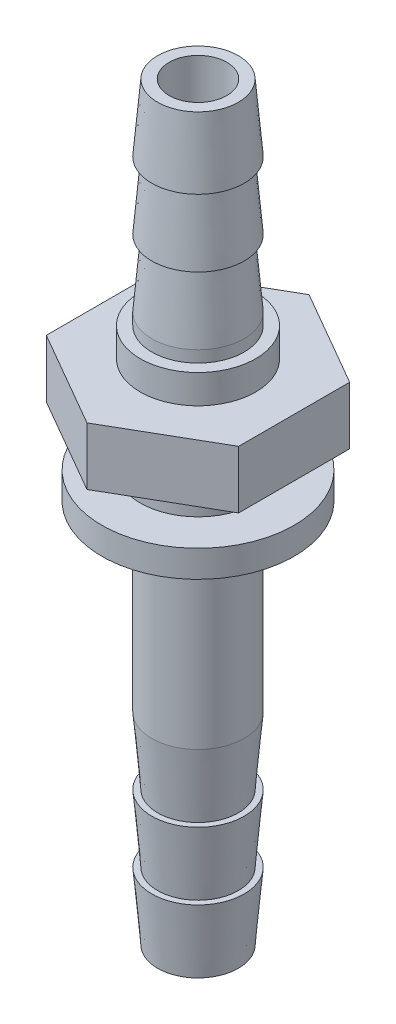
ISO-10303-21;
HEADER;
FILE_DESCRIPTION(('STEP AP214'),'2;1');
FILE_NAME('part.step','',(''),(''),'','','');
FILE_SCHEMA(('AUTOMOTIVE_DESIGN { 1 0 10303 214 1 1 1 1 }'));
ENDSEC;
DATA;
#1=APPLICATION_CONTEXT('core data for automotive mechanical design processes');
#2=APPLICATION_PROTOCOL_DEFINITION('international standard','automotive_design',2000,#1);
#3=PRODUCT_CONTEXT('',#1,'mechanical');
#4=PRODUCT('Part','Part','',(#3));
#5=PRODUCT_RELATED_PRODUCT_CATEGORY('part','',(#4));
#6=PRODUCT_DEFINITION_FORMATION('','',#4);
#7=PRODUCT_DEFINITION_CONTEXT('part definition',#1,'design');
#8=PRODUCT_DEFINITION('design','',#6,#7);
#9=PRODUCT_DEFINITION_SHAPE('','',#8);
#10=(LENGTH_UNIT() NAMED_UNIT(*) SI_UNIT(.MILLI.,.METRE.));
#11=(NAMED_UNIT(*) PLANE_ANGLE_UNIT() SI_UNIT($,.RADIAN.));
#12=(NAMED_UNIT(*) SI_UNIT($,.STERADIAN.) SOLID_ANGLE_UNIT());
#13=UNCERTAINTY_MEASURE_WITH_UNIT(LENGTH_MEASURE(1.E-05),#10,'distance_accuracy_value','');
#14=(GEOMETRIC_REPRESENTATION_CONTEXT(3) GLOBAL_UNCERTAINTY_ASSIGNED_CONTEXT((#13)) GLOBAL_UNIT_ASSIGNED_CONTEXT((#10,
#11,#12)) REPRESENTATION_CONTEXT('',''));
#15=CARTESIAN_POINT('',(0.,0.,0.));
#16=DIRECTION('',(0.,0.,1.));
#17=DIRECTION('',(1.,0.,0.));
#18=AXIS2_PLACEMENT_3D('',#15,#16,#17);
#19=CARTESIAN_POINT('',(0.,0.,0.));
#20=DIRECTION('',(0.,-1.,0.));
#21=DIRECTION('',(0.,0.,-1.));
#22=AXIS2_PLACEMENT_3D('',#19,#20,#21);
#23=CYLINDRICAL_SURFACE('',#22,3.);
#24=CARTESIAN_POINT('',(0.,1.4,0.));
#25=DIRECTION('',(0.,-1.,0.));
#26=DIRECTION('',(0.,0.,-1.));
#27=AXIS2_PLACEMENT_3D('',#24,#25,#26);
#28=CIRCLE('',#27,3.);
#29=CARTESIAN_POINT('',(0.,1.4,-3.));
#30=VERTEX_POINT('',#29);
#31=EDGE_CURVE('E199',#30,#30,#28,.T.);
#32=ORIENTED_EDGE('',*,*,#31,.F.);
#33=EDGE_LOOP('',(#32));
#34=FACE_BOUND('',#33,.T.);
#35=CARTESIAN_POINT('',(0.,3.4,0.));
#36=DIRECTION('',(0.,1.,0.));
#37=DIRECTION('',(0.,0.,1.));
#38=AXIS2_PLACEMENT_3D('',#35,#36,#37);
#39=CIRCLE('',#38,3.);
#40=CARTESIAN_POINT('',(0.,3.4,3.));
#41=VERTEX_POINT('',#40);
#42=EDGE_CURVE('E11',#41,#41,#39,.T.);
#43=ORIENTED_EDGE('',*,*,#42,.F.);
#44=EDGE_LOOP('',(#43));
#45=FACE_BOUND('',#44,.T.);
#46=ADVANCED_FACE('F36',(#34,#45),#23,.T.);
#47=CARTESIAN_POINT('',(0.,0.,0.));
#48=DIRECTION('',(0.,-1.,0.));
#49=DIRECTION('',(0.,0.,-1.));
#50=AXIS2_PLACEMENT_3D('',#47,#48,#49);
#51=CYLINDRICAL_SURFACE('',#50,5.);
#52=CARTESIAN_POINT('',(0.,0.,0.));
#53=DIRECTION('',(0.,-1.,0.));
#54=DIRECTION('',(0.,0.,-1.));
#55=AXIS2_PLACEMENT_3D('',#52,#53,#54);
#56=CIRCLE('',#55,5.);
#57=CARTESIAN_POINT('',(0.,0.,-5.));
#58=VERTEX_POINT('',#57);
#59=EDGE_CURVE('E146',#58,#58,#56,.T.);
#60=ORIENTED_EDGE('',*,*,#59,.F.);
#61=EDGE_LOOP('',(#60));
#62=FACE_BOUND('',#61,.T.);
#63=CARTESIAN_POINT('',(0.,1.4,0.));
#64=DIRECTION('',(0.,-1.,0.));
#65=DIRECTION('',(0.,0.,-1.));
#66=AXIS2_PLACEMENT_3D('',#63,#64,#65);
#67=CIRCLE('',#66,5.);
#68=CARTESIAN_POINT('',(0.,1.4,-5.));
#69=VERTEX_POINT('',#68);
#70=EDGE_CURVE('E40',#69,#69,#67,.T.);
#71=ORIENTED_EDGE('',*,*,#70,.T.);
#72=EDGE_LOOP('',(#71));
#73=FACE_BOUND('',#72,.T.);
#74=ADVANCED_FACE('F38',(#62,#73),#51,.T.);
#75=CARTESIAN_POINT('',(0.,1.4,5.));
#76=DIRECTION('',(0.,-1.,0.));
#77=DIRECTION('',(0.,0.,-1.));
#78=AXIS2_PLACEMENT_3D('',#75,#76,#77);
#79=PLANE('',#78);
#80=ORIENTED_EDGE('',*,*,#70,.F.);
#81=EDGE_LOOP('',(#80));
#82=FACE_BOUND('',#81,.T.);
#83=ORIENTED_EDGE('',*,*,#31,.T.);
#84=EDGE_LOOP('',(#83));
#85=FACE_BOUND('',#84,.T.);
#86=ADVANCED_FACE('F207',(#82,#85),#79,.F.);
#87=CARTESIAN_POINT('',(0.,6.4,0.));
#88=DIRECTION('',(0.,1.,0.));
#89=DIRECTION('',(0.,0.,1.));
#90=AXIS2_PLACEMENT_3D('',#87,#88,#89);
#91=CIRCLE('',#90,3.);
#92=CARTESIAN_POINT('',(0.,6.4,3.));
#93=VERTEX_POINT('',#92);
#94=EDGE_CURVE('E142',#93,#93,#91,.T.);
#95=ORIENTED_EDGE('',*,*,#94,.T.);
#96=EDGE_LOOP('',(#95));
#97=FACE_BOUND('',#96,.T.);
#98=CARTESIAN_POINT('',(0.,7.9,0.));
#99=DIRECTION('',(0.,-1.,0.));
#100=DIRECTION('',(0.,0.,-1.));
#101=AXIS2_PLACEMENT_3D('',#98,#99,#100);
#102=CIRCLE('',#101,3.);
#103=CARTESIAN_POINT('',(0.,7.9,-3.));
#104=VERTEX_POINT('',#103);
#105=EDGE_CURVE('E197',#104,#104,#102,.T.);
#106=ORIENTED_EDGE('',*,*,#105,.T.);
#107=EDGE_LOOP('',(#106));
#108=FACE_BOUND('',#107,.T.);
#109=ADVANCED_FACE('F209',(#97,#108),#23,.T.);
#110=CARTESIAN_POINT('',(0.,7.9,3.));
#111=DIRECTION('',(0.,-1.,0.));
#112=DIRECTION('',(0.,0.,-1.));
#113=AXIS2_PLACEMENT_3D('',#110,#111,#112);
#114=PLANE('',#113);
#115=ORIENTED_EDGE('',*,*,#105,.F.);
#116=EDGE_LOOP('',(#115));
#117=FACE_BOUND('',#116,.T.);
#118=CARTESIAN_POINT('',(0.,7.9,0.));
#119=DIRECTION('',(0.,-1.,0.));
#120=DIRECTION('',(0.,0.,-1.));
#121=AXIS2_PLACEMENT_3D('',#118,#119,#120);
#122=CIRCLE('',#121,2.4);
#123=CARTESIAN_POINT('',(0.,7.9,-2.4));
#124=VERTEX_POINT('',#123);
#125=EDGE_CURVE('E194',#124,#124,#122,.T.);
#126=ORIENTED_EDGE('',*,*,#125,.T.);
#127=EDGE_LOOP('',(#126));
#128=FACE_BOUND('',#127,.T.);
#129=ADVANCED_FACE('F214',(#117,#128),#114,.F.);
#130=CARTESIAN_POINT('',(0.,0.,0.));
#131=DIRECTION('',(0.,-1.,0.));
#132=DIRECTION('',(0.,0.,-1.));
#133=AXIS2_PLACEMENT_3D('',#130,#131,#132);
#134=CYLINDRICAL_SURFACE('',#133,2.4);
#135=ORIENTED_EDGE('',*,*,#125,.F.);
#136=EDGE_LOOP('',(#135));
#137=FACE_BOUND('',#136,.T.);
#138=CARTESIAN_POINT('',(0.,8.5,0.));
#139=DIRECTION('',(0.,-1.,0.));
#140=DIRECTION('',(0.,0.,-1.));
#141=AXIS2_PLACEMENT_3D('',#138,#139,#140);
#142=CIRCLE('',#141,2.4);
#143=CARTESIAN_POINT('',(0.,8.5,-2.4));
#144=VERTEX_POINT('',#143);
#145=EDGE_CURVE('E191',#144,#144,#142,.T.);
#146=ORIENTED_EDGE('',*,*,#145,.T.);
#147=EDGE_LOOP('',(#146));
#148=FACE_BOUND('',#147,.T.);
#149=ADVANCED_FACE('F226',(#137,#148),#134,.T.);
#150=CARTESIAN_POINT('',(0.,12.,0.));
#151=DIRECTION('',(0.,-1.,0.));
#152=DIRECTION('',(0.,0.,-1.));
#153=AXIS2_PLACEMENT_3D('',#150,#151,#152);
#154=CONICAL_SURFACE('',#153,2.1,0.0855052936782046);
#155=ORIENTED_EDGE('',*,*,#145,.F.);
#156=EDGE_LOOP('',(#155));
#157=FACE_BOUND('',#156,.T.);
#158=CARTESIAN_POINT('',(0.,12.,0.));
#159=DIRECTION('',(0.,-1.,0.));
#160=DIRECTION('',(0.,0.,-1.));
#161=AXIS2_PLACEMENT_3D('',#158,#159,#160);
#162=CIRCLE('',#161,2.1);
#163=CARTESIAN_POINT('',(0.,12.,-2.1));
#164=VERTEX_POINT('',#163);
#165=EDGE_CURVE('E188',#164,#164,#162,.T.);
#166=ORIENTED_EDGE('',*,*,#165,.T.);
#167=EDGE_LOOP('',(#166));
#168=FACE_BOUND('',#167,.T.);
#169=ADVANCED_FACE('F230',(#157,#168),#154,.T.);
#170=CARTESIAN_POINT('',(0.,12.,2.1));
#171=DIRECTION('',(0.,1.,0.));
#172=DIRECTION('',(0.,0.,1.));
#173=AXIS2_PLACEMENT_3D('',#170,#171,#172);
#174=PLANE('',#173);
#175=ORIENTED_EDGE('',*,*,#165,.F.);
#176=EDGE_LOOP('',(#175));
#177=FACE_BOUND('',#176,.T.);
#178=CARTESIAN_POINT('',(0.,12.,0.));
#179=DIRECTION('',(0.,-1.,0.));
#180=DIRECTION('',(0.,0.,-1.));
#181=AXIS2_PLACEMENT_3D('',#178,#179,#180);
#182=CIRCLE('',#181,2.4);
#183=CARTESIAN_POINT('',(0.,12.,-2.4));
#184=VERTEX_POINT('',#183);
#185=EDGE_CURVE('E185',#184,#184,#182,.T.);
#186=ORIENTED_EDGE('',*,*,#185,.T.);
#187=EDGE_LOOP('',(#186));
#188=FACE_BOUND('',#187,.T.);
#189=ADVANCED_FACE('F234',(#177,#188),#174,.F.);
#190=CARTESIAN_POINT('',(0.,15.5,0.));
#191=DIRECTION('',(0.,-1.,0.));
#192=DIRECTION('',(0.,0.,-1.));
#193=AXIS2_PLACEMENT_3D('',#190,#191,#192);
#194=CONICAL_SURFACE('',#193,2.1,0.0855052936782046);
#195=ORIENTED_EDGE('',*,*,#185,.F.);
#196=EDGE_LOOP('',(#195));
#197=FACE_BOUND('',#196,.T.);
#198=CARTESIAN_POINT('',(0.,15.5,0.));
#199=DIRECTION('',(0.,-1.,0.));
#200=DIRECTION('',(0.,0.,-1.));
#201=AXIS2_PLACEMENT_3D('',#198,#199,#200);
#202=CIRCLE('',#201,2.1);
#203=CARTESIAN_POINT('',(0.,15.5,-2.1));
#204=VERTEX_POINT('',#203);
#205=EDGE_CURVE('E182',#204,#204,#202,.T.);
#206=ORIENTED_EDGE('',*,*,#205,.T.);
#207=EDGE_LOOP('',(#206));
#208=FACE_BOUND('',#207,.T.);
#209=ADVANCED_FACE('F238',(#197,#208),#194,.T.);
#210=CARTESIAN_POINT('',(0.,15.5,2.1));
#211=DIRECTION('',(0.,1.,0.));
#212=DIRECTION('',(0.,0.,1.));
#213=AXIS2_PLACEMENT_3D('',#210,#211,#212);
#214=PLANE('',#213);
#215=ORIENTED_EDGE('',*,*,#205,.F.);
#216=EDGE_LOOP('',(#215));
#217=FACE_BOUND('',#216,.T.);
#218=CARTESIAN_POINT('',(0.,15.5,0.));
#219=DIRECTION('',(0.,-1.,0.));
#220=DIRECTION('',(0.,0.,-1.));
#221=AXIS2_PLACEMENT_3D('',#218,#219,#220);
#222=CIRCLE('',#221,2.4);
#223=CARTESIAN_POINT('',(0.,15.5,-2.4));
#224=VERTEX_POINT('',#223);
#225=EDGE_CURVE('E179',#224,#224,#222,.T.);
#226=ORIENTED_EDGE('',*,*,#225,.T.);
#227=EDGE_LOOP('',(#226));
#228=FACE_BOUND('',#227,.T.);
#229=ADVANCED_FACE('F242',(#217,#228),#214,.F.);
#230=CARTESIAN_POINT('',(0.,19.,0.));
#231=DIRECTION('',(0.,-1.,0.));
#232=DIRECTION('',(0.,0.,-1.));
#233=AXIS2_PLACEMENT_3D('',#230,#231,#232);
#234=CONICAL_SURFACE('',#233,2.1,0.0855052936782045);
#235=ORIENTED_EDGE('',*,*,#225,.F.);
#236=EDGE_LOOP('',(#235));
#237=FACE_BOUND('',#236,.T.);
#238=CARTESIAN_POINT('',(0.,19.,0.));
#239=DIRECTION('',(0.,-1.,0.));
#240=DIRECTION('',(0.,0.,-1.));
#241=AXIS2_PLACEMENT_3D('',#238,#239,#240);
#242=CIRCLE('',#241,2.1);
#243=CARTESIAN_POINT('',(0.,19.,-2.1));
#244=VERTEX_POINT('',#243);
#245=EDGE_CURVE('E176',#244,#244,#242,.T.);
#246=ORIENTED_EDGE('',*,*,#245,.T.);
#247=EDGE_LOOP('',(#246));
#248=FACE_BOUND('',#247,.T.);
#249=ADVANCED_FACE('F246',(#237,#248),#234,.T.);
#250=CARTESIAN_POINT('',(0.,19.,2.1));
#251=DIRECTION('',(0.,-1.,0.));
#252=DIRECTION('',(0.,0.,-1.));
#253=AXIS2_PLACEMENT_3D('',#250,#251,#252);
#254=PLANE('',#253);
#255=ORIENTED_EDGE('',*,*,#245,.F.);
#256=EDGE_LOOP('',(#255));
#257=FACE_BOUND('',#256,.T.);
#258=CARTESIAN_POINT('',(0.,19.,0.));
#259=DIRECTION('',(0.,-1.,0.));
#260=DIRECTION('',(0.,0.,-1.));
#261=AXIS2_PLACEMENT_3D('',#258,#259,#260);
#262=CIRCLE('',#261,1.5);
#263=CARTESIAN_POINT('',(0.,19.,-1.5));
#264=VERTEX_POINT('',#263);
#265=EDGE_CURVE('E173',#264,#264,#262,.T.);
#266=ORIENTED_EDGE('',*,*,#265,.T.);
#267=EDGE_LOOP('',(#266));
#268=FACE_BOUND('',#267,.T.);
#269=ADVANCED_FACE('F250',(#257,#268),#254,.F.);
#270=CARTESIAN_POINT('',(0.,0.,0.));
#271=DIRECTION('',(0.,-1.,0.));
#272=DIRECTION('',(0.,0.,-1.));
#273=AXIS2_PLACEMENT_3D('',#270,#271,#272);
#274=CYLINDRICAL_SURFACE('',#273,1.5);
#275=ORIENTED_EDGE('',*,*,#265,.F.);
#276=EDGE_LOOP('',(#275));
#277=FACE_BOUND('',#276,.T.);
#278=CARTESIAN_POINT('',(0.,-20.,0.));
#279=DIRECTION('',(0.,-1.,0.));
#280=DIRECTION('',(0.,0.,-1.));
#281=AXIS2_PLACEMENT_3D('',#278,#279,#280);
#282=CIRCLE('',#281,1.5);
#283=CARTESIAN_POINT('',(0.,-20.,-1.5));
#284=VERTEX_POINT('',#283);
#285=EDGE_CURVE('E170',#284,#284,#282,.T.);
#286=ORIENTED_EDGE('',*,*,#285,.T.);
#287=EDGE_LOOP('',(#286));
#288=FACE_BOUND('',#287,.T.);
#289=ADVANCED_FACE('F254',(#277,#288),#274,.F.);
#290=CARTESIAN_POINT('',(0.,-20.,2.1));
#291=DIRECTION('',(0.,1.,0.));
#292=DIRECTION('',(0.,0.,1.));
#293=AXIS2_PLACEMENT_3D('',#290,#291,#292);
#294=PLANE('',#293);
#295=ORIENTED_EDGE('',*,*,#285,.F.);
#296=EDGE_LOOP('',(#295));
#297=FACE_BOUND('',#296,.T.);
#298=CARTESIAN_POINT('',(0.,-20.,0.));
#299=DIRECTION('',(0.,-1.,0.));
#300=DIRECTION('',(0.,0.,-1.));
#301=AXIS2_PLACEMENT_3D('',#298,#299,#300);
#302=CIRCLE('',#301,2.1);
#303=CARTESIAN_POINT('',(0.,-20.,-2.1));
#304=VERTEX_POINT('',#303);
#305=EDGE_CURVE('E167',#304,#304,#302,.T.);
#306=ORIENTED_EDGE('',*,*,#305,.T.);
#307=EDGE_LOOP('',(#306));
#308=FACE_BOUND('',#307,.T.);
#309=ADVANCED_FACE('F258',(#297,#308),#294,.F.);
#310=CARTESIAN_POINT('',(0.,-16.5,0.));
#311=DIRECTION('',(0.,1.,0.));
#312=DIRECTION('',(0.,0.,1.));
#313=AXIS2_PLACEMENT_3D('',#310,#311,#312);
#314=CONICAL_SURFACE('',#313,2.4,0.0855052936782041);
#315=ORIENTED_EDGE('',*,*,#305,.F.);
#316=EDGE_LOOP('',(#315));
#317=FACE_BOUND('',#316,.T.);
#318=CARTESIAN_POINT('',(0.,-16.5,0.));
#319=DIRECTION('',(0.,-1.,0.));
#320=DIRECTION('',(0.,0.,-1.));
#321=AXIS2_PLACEMENT_3D('',#318,#319,#320);
#322=CIRCLE('',#321,2.4);
#323=CARTESIAN_POINT('',(0.,-16.5,-2.4));
#324=VERTEX_POINT('',#323);
#325=EDGE_CURVE('E164',#324,#324,#322,.T.);
#326=ORIENTED_EDGE('',*,*,#325,.T.);
#327=EDGE_LOOP('',(#326));
#328=FACE_BOUND('',#327,.T.);
#329=ADVANCED_FACE('F262',(#317,#328),#314,.T.);
#330=CARTESIAN_POINT('',(0.,-16.5,2.1));
#331=DIRECTION('',(0.,-1.,0.));
#332=DIRECTION('',(0.,0.,-1.));
#333=AXIS2_PLACEMENT_3D('',#330,#331,#332);
#334=PLANE('',#333);
#335=ORIENTED_EDGE('',*,*,#325,.F.);
#336=EDGE_LOOP('',(#335));
#337=FACE_BOUND('',#336,.T.);
#338=CARTESIAN_POINT('',(0.,-16.5,0.));
#339=DIRECTION('',(0.,-1.,0.));
#340=DIRECTION('',(0.,0.,-1.));
#341=AXIS2_PLACEMENT_3D('',#338,#339,#340);
#342=CIRCLE('',#341,2.1);
#343=CARTESIAN_POINT('',(0.,-16.5,-2.1));
#344=VERTEX_POINT('',#343);
#345=EDGE_CURVE('E161',#344,#344,#342,.T.);
#346=ORIENTED_EDGE('',*,*,#345,.T.);
#347=EDGE_LOOP('',(#346));
#348=FACE_BOUND('',#347,.T.);
#349=ADVANCED_FACE('F266',(#337,#348),#334,.F.);
#350=CARTESIAN_POINT('',(0.,-13.,0.));
#351=DIRECTION('',(0.,1.,0.));
#352=DIRECTION('',(0.,0.,1.));
#353=AXIS2_PLACEMENT_3D('',#350,#351,#352);
#354=CONICAL_SURFACE('',#353,2.4,0.0855052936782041);
#355=ORIENTED_EDGE('',*,*,#345,.F.);
#356=EDGE_LOOP('',(#355));
#357=FACE_BOUND('',#356,.T.);
#358=CARTESIAN_POINT('',(0.,-13.,0.));
#359=DIRECTION('',(0.,-1.,0.));
#360=DIRECTION('',(0.,0.,-1.));
#361=AXIS2_PLACEMENT_3D('',#358,#359,#360);
#362=CIRCLE('',#361,2.4);
#363=CARTESIAN_POINT('',(0.,-13.,-2.4));
#364=VERTEX_POINT('',#363);
#365=EDGE_CURVE('E158',#364,#364,#362,.T.);
#366=ORIENTED_EDGE('',*,*,#365,.T.);
#367=EDGE_LOOP('',(#366));
#368=FACE_BOUND('',#367,.T.);
#369=ADVANCED_FACE('F270',(#357,#368),#354,.T.);
#370=CARTESIAN_POINT('',(0.,-13.,2.1));
#371=DIRECTION('',(0.,-1.,0.));
#372=DIRECTION('',(0.,0.,-1.));
#373=AXIS2_PLACEMENT_3D('',#370,#371,#372);
#374=PLANE('',#373);
#375=ORIENTED_EDGE('',*,*,#365,.F.);
#376=EDGE_LOOP('',(#375));
#377=FACE_BOUND('',#376,.T.);
#378=CARTESIAN_POINT('',(0.,-13.,0.));
#379=DIRECTION('',(0.,-1.,0.));
#380=DIRECTION('',(0.,0.,-1.));
#381=AXIS2_PLACEMENT_3D('',#378,#379,#380);
#382=CIRCLE('',#381,2.1);
#383=CARTESIAN_POINT('',(0.,-13.,-2.1));
#384=VERTEX_POINT('',#383);
#385=EDGE_CURVE('E155',#384,#384,#382,.T.);
#386=ORIENTED_EDGE('',*,*,#385,.T.);
#387=EDGE_LOOP('',(#386));
#388=FACE_BOUND('',#387,.T.);
#389=ADVANCED_FACE('F274',(#377,#388),#374,.F.);
#390=CARTESIAN_POINT('',(0.,-9.5,0.));
#391=DIRECTION('',(0.,1.,0.));
#392=DIRECTION('',(0.,0.,1.));
#393=AXIS2_PLACEMENT_3D('',#390,#391,#392);
#394=CONICAL_SURFACE('',#393,2.4,0.0855052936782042);
#395=ORIENTED_EDGE('',*,*,#385,.F.);
#396=EDGE_LOOP('',(#395));
#397=FACE_BOUND('',#396,.T.);
#398=CARTESIAN_POINT('',(0.,-9.5,0.));
#399=DIRECTION('',(0.,-1.,0.));
#400=DIRECTION('',(0.,0.,-1.));
#401=AXIS2_PLACEMENT_3D('',#398,#399,#400);
#402=CIRCLE('',#401,2.4);
#403=CARTESIAN_POINT('',(0.,-9.5,-2.4));
#404=VERTEX_POINT('',#403);
#405=EDGE_CURVE('E152',#404,#404,#402,.T.);
#406=ORIENTED_EDGE('',*,*,#405,.T.);
#407=EDGE_LOOP('',(#406));
#408=FACE_BOUND('',#407,.T.);
#409=ADVANCED_FACE('F278',(#397,#408),#394,.T.);
#410=CARTESIAN_POINT('',(0.,0.,0.));
#411=DIRECTION('',(0.,-1.,0.));
#412=DIRECTION('',(0.,0.,-1.));
#413=AXIS2_PLACEMENT_3D('',#410,#411,#412);
#414=CYLINDRICAL_SURFACE('',#413,2.4);
#415=ORIENTED_EDGE('',*,*,#405,.F.);
#416=EDGE_LOOP('',(#415));
#417=FACE_BOUND('',#416,.T.);
#418=CARTESIAN_POINT('',(0.,0.,0.));
#419=DIRECTION('',(0.,-1.,0.));
#420=DIRECTION('',(0.,0.,-1.));
#421=AXIS2_PLACEMENT_3D('',#418,#419,#420);
#422=CIRCLE('',#421,2.4);
#423=CARTESIAN_POINT('',(0.,0.,-2.4));
#424=VERTEX_POINT('',#423);
#425=EDGE_CURVE('E149',#424,#424,#422,.T.);
#426=ORIENTED_EDGE('',*,*,#425,.T.);
#427=EDGE_LOOP('',(#426));
#428=FACE_BOUND('',#427,.T.);
#429=ADVANCED_FACE('F282',(#417,#428),#414,.T.);
#430=CARTESIAN_POINT('',(0.,0.,2.4));
#431=DIRECTION('',(0.,1.,0.));
#432=DIRECTION('',(0.,0.,1.));
#433=AXIS2_PLACEMENT_3D('',#430,#431,#432);
#434=PLANE('',#433);
#435=ORIENTED_EDGE('',*,*,#425,.F.);
#436=EDGE_LOOP('',(#435));
#437=FACE_BOUND('',#436,.T.);
#438=ORIENTED_EDGE('',*,*,#59,.T.);
#439=EDGE_LOOP('',(#438));
#440=FACE_BOUND('',#439,.T.);
#441=ADVANCED_FACE('F286',(#437,#440),#434,.F.);
#442=CARTESIAN_POINT('',(0.,6.4,0.));
#443=DIRECTION('',(0.,1.,0.));
#444=DIRECTION('',(0.,0.,1.));
#445=AXIS2_PLACEMENT_3D('',#442,#443,#444);
#446=PLANE('',#445);
#447=DIRECTION('',(0.866025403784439,0.,-0.5));
#448=VECTOR('',#447,1.);
#449=CARTESIAN_POINT('',(0.,6.4,5.77350269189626));
#450=LINE('',#449,#448);
#451=CARTESIAN_POINT('',(0.,6.4,5.77350269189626));
#452=VERTEX_POINT('',#451);
#453=CARTESIAN_POINT('',(5.,6.4,2.88675134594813));
#454=VERTEX_POINT('',#453);
#455=EDGE_CURVE('E134',#452,#454,#450,.T.);
#456=ORIENTED_EDGE('',*,*,#455,.T.);
#457=DIRECTION('',(0.,0.,-1.));
#458=VECTOR('',#457,1.);
#459=CARTESIAN_POINT('',(5.,6.4,2.88675134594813));
#460=LINE('',#459,#458);
#461=CARTESIAN_POINT('',(5.,6.4,-2.88675134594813));
#462=VERTEX_POINT('',#461);
#463=EDGE_CURVE('E92',#454,#462,#460,.T.);
#464=ORIENTED_EDGE('',*,*,#463,.T.);
#465=DIRECTION('',(-0.866025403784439,0.,-0.5));
#466=VECTOR('',#465,1.);
#467=CARTESIAN_POINT('',(5.,6.4,-2.88675134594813));
#468=LINE('',#467,#466);
#469=CARTESIAN_POINT('',(0.,6.4,-5.77350269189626));
#470=VERTEX_POINT('',#469);
#471=EDGE_CURVE('E106',#462,#470,#468,.T.);
#472=ORIENTED_EDGE('',*,*,#471,.T.);
#473=DIRECTION('',(-0.866025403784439,0.,0.5));
#474=VECTOR('',#473,1.);
#475=CARTESIAN_POINT('',(0.,6.4,-5.77350269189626));
#476=LINE('',#475,#474);
#477=CARTESIAN_POINT('',(-5.,6.4,-2.88675134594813));
#478=VERTEX_POINT('',#477);
#479=EDGE_CURVE('E99',#470,#478,#476,.T.);
#480=ORIENTED_EDGE('',*,*,#479,.T.);
#481=DIRECTION('',(0.,0.,1.));
#482=VECTOR('',#481,1.);
#483=CARTESIAN_POINT('',(-5.,6.4,-2.88675134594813));
#484=LINE('',#483,#482);
#485=CARTESIAN_POINT('',(-5.,6.4,2.88675134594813));
#486=VERTEX_POINT('',#485);
#487=EDGE_CURVE('E104',#478,#486,#484,.T.);
#488=ORIENTED_EDGE('',*,*,#487,.T.);
#489=DIRECTION('',(0.866025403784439,0.,0.5));
#490=VECTOR('',#489,1.);
#491=CARTESIAN_POINT('',(-5.,6.4,2.88675134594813));
#492=LINE('',#491,#490);
#493=EDGE_CURVE('E54',#486,#452,#492,.T.);
#494=ORIENTED_EDGE('',*,*,#493,.T.);
#495=EDGE_LOOP('',(#456,#464,#472,#480,#488,#494));
#496=FACE_BOUND('',#495,.T.);
#497=ORIENTED_EDGE('',*,*,#94,.F.);
#498=EDGE_LOOP('',(#497));
#499=FACE_BOUND('',#498,.T.);
#500=ADVANCED_FACE('F101',(#496,#499),#446,.T.);
#501=CARTESIAN_POINT('',(0.,3.4,0.));
#502=DIRECTION('',(0.,1.,0.));
#503=DIRECTION('',(0.,0.,1.));
#504=AXIS2_PLACEMENT_3D('',#501,#502,#503);
#505=PLANE('',#504);
#506=DIRECTION('',(0.866025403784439,0.,-0.5));
#507=VECTOR('',#506,1.);
#508=CARTESIAN_POINT('',(0.,3.4,5.77350269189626));
#509=LINE('',#508,#507);
#510=CARTESIAN_POINT('',(0.,3.4,5.77350269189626));
#511=VERTEX_POINT('',#510);
#512=CARTESIAN_POINT('',(5.,3.4,2.88675134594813));
#513=VERTEX_POINT('',#512);
#514=EDGE_CURVE('E124',#511,#513,#509,.T.);
#515=ORIENTED_EDGE('',*,*,#514,.F.);
#516=DIRECTION('',(0.866025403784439,0.,0.5));
#517=VECTOR('',#516,1.);
#518=CARTESIAN_POINT('',(-5.,3.4,2.88675134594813));
#519=LINE('',#518,#517);
#520=CARTESIAN_POINT('',(-5.,3.4,2.88675134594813));
#521=VERTEX_POINT('',#520);
#522=EDGE_CURVE('E83',#521,#511,#519,.T.);
#523=ORIENTED_EDGE('',*,*,#522,.F.);
#524=DIRECTION('',(0.,0.,1.));
#525=VECTOR('',#524,1.);
#526=CARTESIAN_POINT('',(-5.,3.4,-2.88675134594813));
#527=LINE('',#526,#525);
#528=CARTESIAN_POINT('',(-5.,3.4,-2.88675134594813));
#529=VERTEX_POINT('',#528);
#530=EDGE_CURVE('E77',#529,#521,#527,.T.);
#531=ORIENTED_EDGE('',*,*,#530,.F.);
#532=DIRECTION('',(-0.866025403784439,0.,0.5));
#533=VECTOR('',#532,1.);
#534=CARTESIAN_POINT('',(0.,3.4,-5.77350269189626));
#535=LINE('',#534,#533);
#536=CARTESIAN_POINT('',(0.,3.4,-5.77350269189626));
#537=VERTEX_POINT('',#536);
#538=EDGE_CURVE('E114',#537,#529,#535,.T.);
#539=ORIENTED_EDGE('',*,*,#538,.F.);
#540=DIRECTION('',(-0.866025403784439,0.,-0.5));
#541=VECTOR('',#540,1.);
#542=CARTESIAN_POINT('',(5.,3.4,-2.88675134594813));
#543=LINE('',#542,#541);
#544=CARTESIAN_POINT('',(5.,3.4,-2.88675134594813));
#545=VERTEX_POINT('',#544);
#546=EDGE_CURVE('E129',#545,#537,#543,.T.);
#547=ORIENTED_EDGE('',*,*,#546,.F.);
#548=DIRECTION('',(0.,0.,-1.));
#549=VECTOR('',#548,1.);
#550=CARTESIAN_POINT('',(5.,3.4,2.88675134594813));
#551=LINE('',#550,#549);
#552=EDGE_CURVE('E127',#513,#545,#551,.T.);
#553=ORIENTED_EDGE('',*,*,#552,.F.);
#554=EDGE_LOOP('',(#515,#523,#531,#539,#547,#553));
#555=FACE_BOUND('',#554,.T.);
#556=ORIENTED_EDGE('',*,*,#42,.T.);
#557=EDGE_LOOP('',(#556));
#558=FACE_BOUND('',#557,.T.);
#559=ADVANCED_FACE('F295',(#555,#558),#505,.F.);
#560=CARTESIAN_POINT('',(0.,6.4,5.77350269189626));
#561=DIRECTION('',(-0.5,0.,-0.866025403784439));
#562=DIRECTION('',(-0.866025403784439,0.,0.5));
#563=AXIS2_PLACEMENT_3D('',#560,#561,#562);
#564=PLANE('',#563);
#565=ORIENTED_EDGE('',*,*,#514,.T.);
#566=DIRECTION('',(0.,-1.,0.));
#567=VECTOR('',#566,1.);
#568=CARTESIAN_POINT('',(5.,6.4,2.88675134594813));
#569=LINE('',#568,#567);
#570=EDGE_CURVE('E141',#454,#513,#569,.T.);
#571=ORIENTED_EDGE('',*,*,#570,.F.);
#572=ORIENTED_EDGE('',*,*,#455,.F.);
#573=DIRECTION('',(0.,-1.,0.));
#574=VECTOR('',#573,1.);
#575=CARTESIAN_POINT('',(0.,6.4,5.77350269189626));
#576=LINE('',#575,#574);
#577=EDGE_CURVE('E120',#452,#511,#576,.T.);
#578=ORIENTED_EDGE('',*,*,#577,.T.);
#579=EDGE_LOOP('',(#565,#571,#572,#578));
#580=FACE_BOUND('',#579,.T.);
#581=ADVANCED_FACE('F291',(#580),#564,.F.);
#582=CARTESIAN_POINT('',(5.,6.4,2.88675134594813));
#583=DIRECTION('',(-1.,0.,0.));
#584=DIRECTION('',(0.,0.,1.));
#585=AXIS2_PLACEMENT_3D('',#582,#583,#584);
#586=PLANE('',#585);
#587=ORIENTED_EDGE('',*,*,#552,.T.);
#588=DIRECTION('',(0.,-1.,0.));
#589=VECTOR('',#588,1.);
#590=CARTESIAN_POINT('',(5.,6.4,-2.88675134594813));
#591=LINE('',#590,#589);
#592=EDGE_CURVE('E138',#462,#545,#591,.T.);
#593=ORIENTED_EDGE('',*,*,#592,.F.);
#594=ORIENTED_EDGE('',*,*,#463,.F.);
#595=ORIENTED_EDGE('',*,*,#570,.T.);
#596=EDGE_LOOP('',(#587,#593,#594,#595));
#597=FACE_BOUND('',#596,.T.);
#598=ADVANCED_FACE('F294',(#597),#586,.F.);
#599=CARTESIAN_POINT('',(5.,6.4,-2.88675134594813));
#600=DIRECTION('',(-0.5,0.,0.866025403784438));
#601=DIRECTION('',(0.866025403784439,0.,0.5));
#602=AXIS2_PLACEMENT_3D('',#599,#600,#601);
#603=PLANE('',#602);
#604=ORIENTED_EDGE('',*,*,#546,.T.);
#605=DIRECTION('',(0.,-1.,0.));
#606=VECTOR('',#605,1.);
#607=CARTESIAN_POINT('',(0.,6.4,-5.77350269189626));
#608=LINE('',#607,#606);
#609=EDGE_CURVE('E115',#470,#537,#608,.T.);
#610=ORIENTED_EDGE('',*,*,#609,.F.);
#611=ORIENTED_EDGE('',*,*,#471,.F.);
#612=ORIENTED_EDGE('',*,*,#592,.T.);
#613=EDGE_LOOP('',(#604,#610,#611,#612));
#614=FACE_BOUND('',#613,.T.);
#615=ADVANCED_FACE('F299',(#614),#603,.F.);
#616=CARTESIAN_POINT('',(0.,6.4,-5.77350269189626));
#617=DIRECTION('',(0.5,0.,0.866025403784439));
#618=DIRECTION('',(0.866025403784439,0.,-0.5));
#619=AXIS2_PLACEMENT_3D('',#616,#617,#618);
#620=PLANE('',#619);
#621=ORIENTED_EDGE('',*,*,#538,.T.);
#622=DIRECTION('',(0.,-1.,0.));
#623=VECTOR('',#622,1.);
#624=CARTESIAN_POINT('',(-5.,6.4,-2.88675134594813));
#625=LINE('',#624,#623);
#626=EDGE_CURVE('E111',#478,#529,#625,.T.);
#627=ORIENTED_EDGE('',*,*,#626,.F.);
#628=ORIENTED_EDGE('',*,*,#479,.F.);
#629=ORIENTED_EDGE('',*,*,#609,.T.);
#630=EDGE_LOOP('',(#621,#627,#628,#629));
#631=FACE_BOUND('',#630,.T.);
#632=ADVANCED_FACE('F112',(#631),#620,.F.);
#633=CARTESIAN_POINT('',(-5.,6.4,-2.88675134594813));
#634=DIRECTION('',(1.,0.,0.));
#635=DIRECTION('',(0.,0.,-1.));
#636=AXIS2_PLACEMENT_3D('',#633,#634,#635);
#637=PLANE('',#636);
#638=ORIENTED_EDGE('',*,*,#530,.T.);
#639=DIRECTION('',(0.,-1.,0.));
#640=VECTOR('',#639,1.);
#641=CARTESIAN_POINT('',(-5.,6.4,2.88675134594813));
#642=LINE('',#641,#640);
#643=EDGE_CURVE('E116',#486,#521,#642,.T.);
#644=ORIENTED_EDGE('',*,*,#643,.F.);
#645=ORIENTED_EDGE('',*,*,#487,.F.);
#646=ORIENTED_EDGE('',*,*,#626,.T.);
#647=EDGE_LOOP('',(#638,#644,#645,#646));
#648=FACE_BOUND('',#647,.T.);
#649=ADVANCED_FACE('F118',(#648),#637,.F.);
#650=CARTESIAN_POINT('',(-5.,6.4,2.88675134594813));
#651=DIRECTION('',(0.5,0.,-0.866025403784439));
#652=DIRECTION('',(-0.866025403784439,0.,-0.5));
#653=AXIS2_PLACEMENT_3D('',#650,#651,#652);
#654=PLANE('',#653);
#655=ORIENTED_EDGE('',*,*,#522,.T.);
#656=ORIENTED_EDGE('',*,*,#577,.F.);
#657=ORIENTED_EDGE('',*,*,#493,.F.);
#658=ORIENTED_EDGE('',*,*,#643,.T.);
#659=EDGE_LOOP('',(#655,#656,#657,#658));
#660=FACE_BOUND('',#659,.T.);
#661=ADVANCED_FACE('F307',(#660),#654,.F.);
#662=CLOSED_SHELL('',(#46,#74,#86,#109,#129,#149,#169,#189,#209,#229,#249,#269,#289,#309,#329,
#349,#369,#389,#409,#429,#441,#500,#559,#581,#598,#615,#632,#649,#661));
#663=MANIFOLD_SOLID_BREP('B2',#662);
#664=ADVANCED_BREP_SHAPE_REPRESENTATION('',(#18,#663),#14);
#665=SHAPE_DEFINITION_REPRESENTATION(#9,#664);
ENDSEC;
END-ISO-10303-21;
